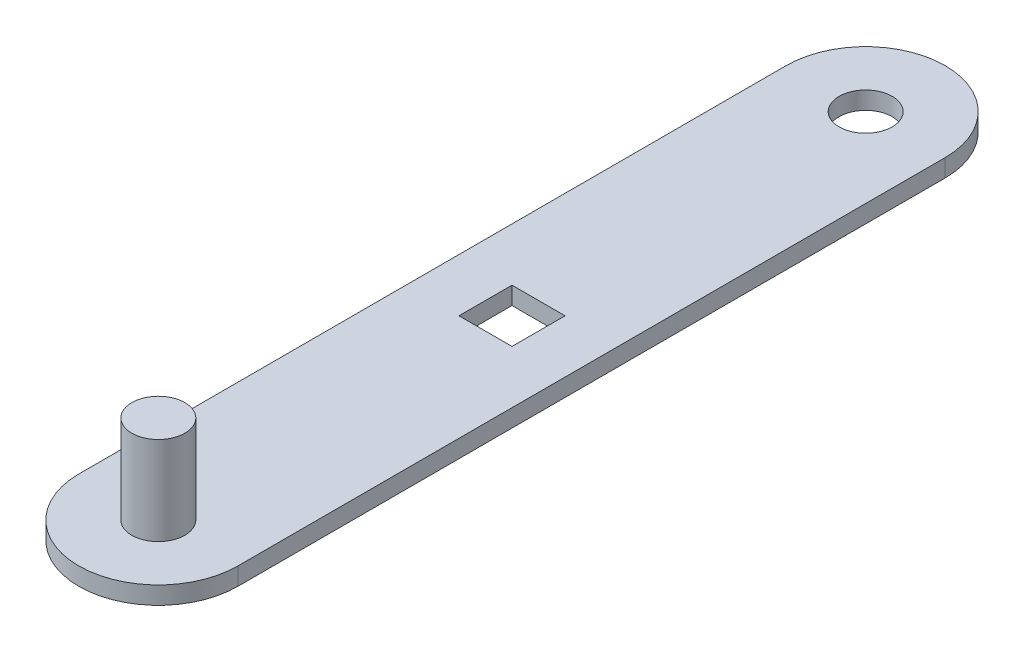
ISO-10303-21;
HEADER;
FILE_DESCRIPTION(('STEP AP214'),'2;1');
FILE_NAME('part.step','',(''),(''),'','','');
FILE_SCHEMA(('AUTOMOTIVE_DESIGN { 1 0 10303 214 1 1 1 1 }'));
ENDSEC;
DATA;
#1=APPLICATION_CONTEXT('core data for automotive mechanical design processes');
#2=APPLICATION_PROTOCOL_DEFINITION('international standard','automotive_design',2000,#1);
#3=PRODUCT_CONTEXT('',#1,'mechanical');
#4=PRODUCT('Part','Part','',(#3));
#5=PRODUCT_RELATED_PRODUCT_CATEGORY('part','',(#4));
#6=PRODUCT_DEFINITION_FORMATION('','',#4);
#7=PRODUCT_DEFINITION_CONTEXT('part definition',#1,'design');
#8=PRODUCT_DEFINITION('design','',#6,#7);
#9=PRODUCT_DEFINITION_SHAPE('','',#8);
#10=(LENGTH_UNIT() NAMED_UNIT(*) SI_UNIT(.MILLI.,.METRE.));
#11=(NAMED_UNIT(*) PLANE_ANGLE_UNIT() SI_UNIT($,.RADIAN.));
#12=(NAMED_UNIT(*) SI_UNIT($,.STERADIAN.) SOLID_ANGLE_UNIT());
#13=UNCERTAINTY_MEASURE_WITH_UNIT(LENGTH_MEASURE(1.E-05),#10,'distance_accuracy_value','');
#14=(GEOMETRIC_REPRESENTATION_CONTEXT(3) GLOBAL_UNCERTAINTY_ASSIGNED_CONTEXT((#13)) GLOBAL_UNIT_ASSIGNED_CONTEXT((#10,
#11,#12)) REPRESENTATION_CONTEXT('',''));
#15=CARTESIAN_POINT('',(0.,0.,0.));
#16=DIRECTION('',(0.,0.,1.));
#17=DIRECTION('',(1.,0.,0.));
#18=AXIS2_PLACEMENT_3D('',#15,#16,#17);
#19=CARTESIAN_POINT('',(-225.,50.,0.));
#20=DIRECTION('',(-1.,0.,0.));
#21=DIRECTION('',(0.,0.,1.));
#22=AXIS2_PLACEMENT_3D('',#19,#20,#21);
#23=PLANE('',#22);
#24=DIRECTION('',(0.,0.,-1.));
#25=VECTOR('',#24,1.);
#26=CARTESIAN_POINT('',(-225.,0.,0.));
#27=LINE('',#26,#25);
#28=CARTESIAN_POINT('',(-225.,0.,1000.));
#29=VERTEX_POINT('',#28);
#30=CARTESIAN_POINT('',(-225.,0.,-1000.));
#31=VERTEX_POINT('',#30);
#32=EDGE_CURVE('E158',#29,#31,#27,.T.);
#33=ORIENTED_EDGE('',*,*,#32,.F.);
#34=DIRECTION('',(0.,-1.,0.));
#35=VECTOR('',#34,1.);
#36=CARTESIAN_POINT('',(-225.,50.,1000.));
#37=LINE('',#36,#35);
#38=CARTESIAN_POINT('',(-225.,50.,1000.));
#39=VERTEX_POINT('',#38);
#40=EDGE_CURVE('E13',#39,#29,#37,.T.);
#41=ORIENTED_EDGE('',*,*,#40,.F.);
#42=DIRECTION('',(0.,0.,-1.));
#43=VECTOR('',#42,1.);
#44=CARTESIAN_POINT('',(-225.,50.,0.));
#45=LINE('',#44,#43);
#46=CARTESIAN_POINT('',(-225.,50.,-1000.));
#47=VERTEX_POINT('',#46);
#48=EDGE_CURVE('E162',#39,#47,#45,.T.);
#49=ORIENTED_EDGE('',*,*,#48,.T.);
#50=DIRECTION('',(0.,-1.,0.));
#51=VECTOR('',#50,1.);
#52=CARTESIAN_POINT('',(-225.,50.,-1000.));
#53=LINE('',#52,#51);
#54=EDGE_CURVE('E173',#47,#31,#53,.T.);
#55=ORIENTED_EDGE('',*,*,#54,.T.);
#56=EDGE_LOOP('',(#33,#41,#49,#55));
#57=FACE_BOUND('',#56,.T.);
#58=ADVANCED_FACE('F52',(#57),#23,.T.);
#59=CARTESIAN_POINT('',(0.,50.,1000.));
#60=DIRECTION('',(0.,-1.,0.));
#61=DIRECTION('',(0.,0.,-1.));
#62=AXIS2_PLACEMENT_3D('',#59,#60,#61);
#63=CYLINDRICAL_SURFACE('',#62,225.);
#64=CARTESIAN_POINT('',(0.,0.,1000.));
#65=DIRECTION('',(0.,1.,0.));
#66=DIRECTION('',(0.,0.,1.));
#67=AXIS2_PLACEMENT_3D('',#64,#65,#66);
#68=CIRCLE('',#67,225.);
#69=CARTESIAN_POINT('',(225.,0.,1000.));
#70=VERTEX_POINT('',#69);
#71=EDGE_CURVE('E176',#70,#29,#68,.F.);
#72=ORIENTED_EDGE('',*,*,#71,.F.);
#73=DIRECTION('',(0.,-1.,0.));
#74=VECTOR('',#73,1.);
#75=CARTESIAN_POINT('',(225.,50.,1000.));
#76=LINE('',#75,#74);
#77=CARTESIAN_POINT('',(225.,50.,1000.));
#78=VERTEX_POINT('',#77);
#79=EDGE_CURVE('E60',#78,#70,#76,.T.);
#80=ORIENTED_EDGE('',*,*,#79,.F.);
#81=CARTESIAN_POINT('',(0.,50.,1000.));
#82=DIRECTION('',(0.,1.,0.));
#83=DIRECTION('',(0.,0.,1.));
#84=AXIS2_PLACEMENT_3D('',#81,#82,#83);
#85=CIRCLE('',#84,225.);
#86=EDGE_CURVE('E165',#78,#39,#85,.F.);
#87=ORIENTED_EDGE('',*,*,#86,.T.);
#88=ORIENTED_EDGE('',*,*,#40,.T.);
#89=EDGE_LOOP('',(#72,#80,#87,#88));
#90=FACE_BOUND('',#89,.T.);
#91=ADVANCED_FACE('F197',(#90),#63,.T.);
#92=CARTESIAN_POINT('',(225.,50.,0.));
#93=DIRECTION('',(-1.,0.,0.));
#94=DIRECTION('',(0.,0.,1.));
#95=AXIS2_PLACEMENT_3D('',#92,#93,#94);
#96=PLANE('',#95);
#97=DIRECTION('',(0.,0.,-1.));
#98=VECTOR('',#97,1.);
#99=CARTESIAN_POINT('',(225.,0.,0.));
#100=LINE('',#99,#98);
#101=CARTESIAN_POINT('',(225.,0.,-1000.));
#102=VERTEX_POINT('',#101);
#103=EDGE_CURVE('E179',#70,#102,#100,.T.);
#104=ORIENTED_EDGE('',*,*,#103,.T.);
#105=DIRECTION('',(0.,-1.,0.));
#106=VECTOR('',#105,1.);
#107=CARTESIAN_POINT('',(225.,50.,-1000.));
#108=LINE('',#107,#106);
#109=CARTESIAN_POINT('',(225.,50.,-1000.));
#110=VERTEX_POINT('',#109);
#111=EDGE_CURVE('E184',#110,#102,#108,.T.);
#112=ORIENTED_EDGE('',*,*,#111,.F.);
#113=DIRECTION('',(0.,0.,-1.));
#114=VECTOR('',#113,1.);
#115=CARTESIAN_POINT('',(225.,50.,0.));
#116=LINE('',#115,#114);
#117=EDGE_CURVE('E169',#78,#110,#116,.T.);
#118=ORIENTED_EDGE('',*,*,#117,.F.);
#119=ORIENTED_EDGE('',*,*,#79,.T.);
#120=EDGE_LOOP('',(#104,#112,#118,#119));
#121=FACE_BOUND('',#120,.T.);
#122=ADVANCED_FACE('F190',(#121),#96,.F.);
#123=CARTESIAN_POINT('',(0.,50.,-1000.));
#124=DIRECTION('',(0.,-1.,0.));
#125=DIRECTION('',(0.,0.,-1.));
#126=AXIS2_PLACEMENT_3D('',#123,#124,#125);
#127=CYLINDRICAL_SURFACE('',#126,225.);
#128=CARTESIAN_POINT('',(0.,0.,-1000.));
#129=DIRECTION('',(0.,1.,0.));
#130=DIRECTION('',(0.,0.,1.));
#131=AXIS2_PLACEMENT_3D('',#128,#129,#130);
#132=CIRCLE('',#131,225.);
#133=EDGE_CURVE('E166',#102,#31,#132,.T.);
#134=ORIENTED_EDGE('',*,*,#133,.T.);
#135=ORIENTED_EDGE('',*,*,#54,.F.);
#136=CARTESIAN_POINT('',(0.,50.,-1000.));
#137=DIRECTION('',(0.,1.,0.));
#138=DIRECTION('',(0.,0.,1.));
#139=AXIS2_PLACEMENT_3D('',#136,#137,#138);
#140=CIRCLE('',#139,225.);
#141=EDGE_CURVE('E171',#110,#47,#140,.T.);
#142=ORIENTED_EDGE('',*,*,#141,.F.);
#143=ORIENTED_EDGE('',*,*,#111,.T.);
#144=EDGE_LOOP('',(#134,#135,#142,#143));
#145=FACE_BOUND('',#144,.T.);
#146=ADVANCED_FACE('F204',(#145),#127,.T.);
#147=CARTESIAN_POINT('',(0.,50.,0.));
#148=DIRECTION('',(0.,1.,0.));
#149=DIRECTION('',(0.,0.,1.));
#150=AXIS2_PLACEMENT_3D('',#147,#148,#149);
#151=PLANE('',#150);
#152=DIRECTION('',(0.,0.,-1.));
#153=VECTOR('',#152,1.);
#154=CARTESIAN_POINT('',(75.,50.,75.));
#155=LINE('',#154,#153);
#156=CARTESIAN_POINT('',(75.,50.,75.));
#157=VERTEX_POINT('',#156);
#158=CARTESIAN_POINT('',(75.,50.,-75.));
#159=VERTEX_POINT('',#158);
#160=EDGE_CURVE('E67',#157,#159,#155,.T.);
#161=ORIENTED_EDGE('',*,*,#160,.F.);
#162=DIRECTION('',(1.,0.,0.));
#163=VECTOR('',#162,1.);
#164=CARTESIAN_POINT('',(-75.,50.,75.));
#165=LINE('',#164,#163);
#166=CARTESIAN_POINT('',(-75.,50.,75.));
#167=VERTEX_POINT('',#166);
#168=EDGE_CURVE('E134',#167,#157,#165,.T.);
#169=ORIENTED_EDGE('',*,*,#168,.F.);
#170=DIRECTION('',(0.,0.,1.));
#171=VECTOR('',#170,1.);
#172=CARTESIAN_POINT('',(-75.,50.,75.));
#173=LINE('',#172,#171);
#174=CARTESIAN_POINT('',(-75.,50.,-75.));
#175=VERTEX_POINT('',#174);
#176=EDGE_CURVE('E137',#175,#167,#173,.T.);
#177=ORIENTED_EDGE('',*,*,#176,.F.);
#178=DIRECTION('',(-1.,0.,0.));
#179=VECTOR('',#178,1.);
#180=CARTESIAN_POINT('',(-75.,50.,-75.));
#181=LINE('',#180,#179);
#182=EDGE_CURVE('E143',#159,#175,#181,.T.);
#183=ORIENTED_EDGE('',*,*,#182,.F.);
#184=EDGE_LOOP('',(#161,#169,#177,#183));
#185=FACE_BOUND('',#184,.T.);
#186=CARTESIAN_POINT('',(0.,50.,-1000.));
#187=DIRECTION('',(0.,1.,0.));
#188=DIRECTION('',(0.,0.,1.));
#189=AXIS2_PLACEMENT_3D('',#186,#187,#188);
#190=CIRCLE('',#189,75.);
#191=CARTESIAN_POINT('',(0.,50.,-925.));
#192=VERTEX_POINT('',#191);
#193=EDGE_CURVE('E149',#192,#192,#190,.T.);
#194=ORIENTED_EDGE('',*,*,#193,.F.);
#195=EDGE_LOOP('',(#194));
#196=FACE_BOUND('',#195,.T.);
#197=CARTESIAN_POINT('',(0.,50.,1000.));
#198=DIRECTION('',(0.,1.,0.));
#199=DIRECTION('',(0.,0.,1.));
#200=AXIS2_PLACEMENT_3D('',#197,#198,#199);
#201=CIRCLE('',#200,75.);
#202=CARTESIAN_POINT('',(0.,50.,1075.));
#203=VERTEX_POINT('',#202);
#204=EDGE_CURVE('E159',#203,#203,#201,.T.);
#205=ORIENTED_EDGE('',*,*,#204,.F.);
#206=EDGE_LOOP('',(#205));
#207=FACE_BOUND('',#206,.T.);
#208=ORIENTED_EDGE('',*,*,#48,.F.);
#209=ORIENTED_EDGE('',*,*,#86,.F.);
#210=ORIENTED_EDGE('',*,*,#117,.T.);
#211=ORIENTED_EDGE('',*,*,#141,.T.);
#212=EDGE_LOOP('',(#208,#209,#210,#211));
#213=FACE_BOUND('',#212,.T.);
#214=ADVANCED_FACE('F206',(#185,#196,#207,#213),#151,.T.);
#215=CARTESIAN_POINT('',(0.,0.,0.));
#216=DIRECTION('',(0.,1.,0.));
#217=DIRECTION('',(0.,0.,1.));
#218=AXIS2_PLACEMENT_3D('',#215,#216,#217);
#219=PLANE('',#218);
#220=DIRECTION('',(1.,0.,0.));
#221=VECTOR('',#220,1.);
#222=CARTESIAN_POINT('',(-75.,0.,75.));
#223=LINE('',#222,#221);
#224=CARTESIAN_POINT('',(-75.,0.,75.));
#225=VERTEX_POINT('',#224);
#226=CARTESIAN_POINT('',(75.,0.,75.));
#227=VERTEX_POINT('',#226);
#228=EDGE_CURVE('E124',#225,#227,#223,.T.);
#229=ORIENTED_EDGE('',*,*,#228,.T.);
#230=DIRECTION('',(0.,0.,-1.));
#231=VECTOR('',#230,1.);
#232=CARTESIAN_POINT('',(75.,0.,75.));
#233=LINE('',#232,#231);
#234=CARTESIAN_POINT('',(75.,0.,-75.));
#235=VERTEX_POINT('',#234);
#236=EDGE_CURVE('E118',#227,#235,#233,.T.);
#237=ORIENTED_EDGE('',*,*,#236,.T.);
#238=DIRECTION('',(-1.,0.,0.));
#239=VECTOR('',#238,1.);
#240=CARTESIAN_POINT('',(-75.,0.,-75.));
#241=LINE('',#240,#239);
#242=CARTESIAN_POINT('',(-75.,0.,-75.));
#243=VERTEX_POINT('',#242);
#244=EDGE_CURVE('E127',#235,#243,#241,.T.);
#245=ORIENTED_EDGE('',*,*,#244,.T.);
#246=DIRECTION('',(0.,0.,1.));
#247=VECTOR('',#246,1.);
#248=CARTESIAN_POINT('',(-75.,0.,75.));
#249=LINE('',#248,#247);
#250=EDGE_CURVE('E75',#243,#225,#249,.T.);
#251=ORIENTED_EDGE('',*,*,#250,.T.);
#252=EDGE_LOOP('',(#229,#237,#245,#251));
#253=FACE_BOUND('',#252,.T.);
#254=CARTESIAN_POINT('',(0.,0.,-1000.));
#255=DIRECTION('',(0.,1.,0.));
#256=DIRECTION('',(0.,0.,1.));
#257=AXIS2_PLACEMENT_3D('',#254,#255,#256);
#258=CIRCLE('',#257,75.);
#259=CARTESIAN_POINT('',(0.,0.,-925.));
#260=VERTEX_POINT('',#259);
#261=EDGE_CURVE('E55',#260,#260,#258,.T.);
#262=ORIENTED_EDGE('',*,*,#261,.T.);
#263=EDGE_LOOP('',(#262));
#264=FACE_BOUND('',#263,.T.);
#265=ORIENTED_EDGE('',*,*,#32,.T.);
#266=ORIENTED_EDGE('',*,*,#133,.F.);
#267=ORIENTED_EDGE('',*,*,#103,.F.);
#268=ORIENTED_EDGE('',*,*,#71,.T.);
#269=EDGE_LOOP('',(#265,#266,#267,#268));
#270=FACE_BOUND('',#269,.T.);
#271=ADVANCED_FACE('F131',(#253,#264,#270),#219,.F.);
#272=CARTESIAN_POINT('',(0.,300.,1000.));
#273=DIRECTION('',(0.,-1.,0.));
#274=DIRECTION('',(0.,0.,-1.));
#275=AXIS2_PLACEMENT_3D('',#272,#273,#274);
#276=CYLINDRICAL_SURFACE('',#275,75.);
#277=CARTESIAN_POINT('',(0.,300.,1000.));
#278=DIRECTION('',(0.,1.,0.));
#279=DIRECTION('',(0.,0.,1.));
#280=AXIS2_PLACEMENT_3D('',#277,#278,#279);
#281=CIRCLE('',#280,75.);
#282=CARTESIAN_POINT('',(0.,300.,1075.));
#283=VERTEX_POINT('',#282);
#284=EDGE_CURVE('E155',#283,#283,#281,.T.);
#285=ORIENTED_EDGE('',*,*,#284,.F.);
#286=EDGE_LOOP('',(#285));
#287=FACE_BOUND('',#286,.T.);
#288=ORIENTED_EDGE('',*,*,#204,.T.);
#289=EDGE_LOOP('',(#288));
#290=FACE_BOUND('',#289,.T.);
#291=ADVANCED_FACE('F214',(#287,#290),#276,.T.);
#292=CARTESIAN_POINT('',(0.,300.,0.));
#293=DIRECTION('',(0.,1.,0.));
#294=DIRECTION('',(0.,0.,1.));
#295=AXIS2_PLACEMENT_3D('',#292,#293,#294);
#296=PLANE('',#295);
#297=ORIENTED_EDGE('',*,*,#284,.T.);
#298=EDGE_LOOP('',(#297));
#299=FACE_BOUND('',#298,.T.);
#300=ADVANCED_FACE('F255',(#299),#296,.T.);
#301=CARTESIAN_POINT('',(0.,-200.,-1000.));
#302=DIRECTION('',(0.,1.,0.));
#303=DIRECTION('',(0.,0.,1.));
#304=AXIS2_PLACEMENT_3D('',#301,#302,#303);
#305=CYLINDRICAL_SURFACE('',#304,75.);
#306=ORIENTED_EDGE('',*,*,#193,.T.);
#307=EDGE_LOOP('',(#306));
#308=FACE_BOUND('',#307,.T.);
#309=ORIENTED_EDGE('',*,*,#261,.F.);
#310=EDGE_LOOP('',(#309));
#311=FACE_BOUND('',#310,.T.);
#312=ADVANCED_FACE('F261',(#308,#311),#305,.F.);
#313=CARTESIAN_POINT('',(75.,0.,75.));
#314=DIRECTION('',(1.,0.,0.));
#315=DIRECTION('',(0.,0.,-1.));
#316=AXIS2_PLACEMENT_3D('',#313,#314,#315);
#317=PLANE('',#316);
#318=ORIENTED_EDGE('',*,*,#160,.T.);
#319=DIRECTION('',(0.,1.,0.));
#320=VECTOR('',#319,1.);
#321=CARTESIAN_POINT('',(75.,0.,-75.));
#322=LINE('',#321,#320);
#323=EDGE_CURVE('E114',#235,#159,#322,.T.);
#324=ORIENTED_EDGE('',*,*,#323,.F.);
#325=ORIENTED_EDGE('',*,*,#236,.F.);
#326=DIRECTION('',(0.,1.,0.));
#327=VECTOR('',#326,1.);
#328=CARTESIAN_POINT('',(75.,0.,75.));
#329=LINE('',#328,#327);
#330=EDGE_CURVE('E147',#227,#157,#329,.T.);
#331=ORIENTED_EDGE('',*,*,#330,.T.);
#332=EDGE_LOOP('',(#318,#324,#325,#331));
#333=FACE_BOUND('',#332,.T.);
#334=ADVANCED_FACE('F116',(#333),#317,.F.);
#335=CARTESIAN_POINT('',(-75.,0.,75.));
#336=DIRECTION('',(0.,0.,1.));
#337=DIRECTION('',(1.,0.,0.));
#338=AXIS2_PLACEMENT_3D('',#335,#336,#337);
#339=PLANE('',#338);
#340=ORIENTED_EDGE('',*,*,#168,.T.);
#341=ORIENTED_EDGE('',*,*,#330,.F.);
#342=ORIENTED_EDGE('',*,*,#228,.F.);
#343=DIRECTION('',(0.,1.,0.));
#344=VECTOR('',#343,1.);
#345=CARTESIAN_POINT('',(-75.,0.,75.));
#346=LINE('',#345,#344);
#347=EDGE_CURVE('E150',#225,#167,#346,.T.);
#348=ORIENTED_EDGE('',*,*,#347,.T.);
#349=EDGE_LOOP('',(#340,#341,#342,#348));
#350=FACE_BOUND('',#349,.T.);
#351=ADVANCED_FACE('F274',(#350),#339,.F.);
#352=CARTESIAN_POINT('',(-75.,0.,75.));
#353=DIRECTION('',(-1.,0.,0.));
#354=DIRECTION('',(0.,0.,1.));
#355=AXIS2_PLACEMENT_3D('',#352,#353,#354);
#356=PLANE('',#355);
#357=ORIENTED_EDGE('',*,*,#176,.T.);
#358=ORIENTED_EDGE('',*,*,#347,.F.);
#359=ORIENTED_EDGE('',*,*,#250,.F.);
#360=DIRECTION('',(0.,1.,0.));
#361=VECTOR('',#360,1.);
#362=CARTESIAN_POINT('',(-75.,0.,-75.));
#363=LINE('',#362,#361);
#364=EDGE_CURVE('E123',#243,#175,#363,.T.);
#365=ORIENTED_EDGE('',*,*,#364,.T.);
#366=EDGE_LOOP('',(#357,#358,#359,#365));
#367=FACE_BOUND('',#366,.T.);
#368=ADVANCED_FACE('F281',(#367),#356,.F.);
#369=CARTESIAN_POINT('',(-75.,0.,-75.));
#370=DIRECTION('',(0.,0.,-1.));
#371=DIRECTION('',(-1.,0.,0.));
#372=AXIS2_PLACEMENT_3D('',#369,#370,#371);
#373=PLANE('',#372);
#374=ORIENTED_EDGE('',*,*,#182,.T.);
#375=ORIENTED_EDGE('',*,*,#364,.F.);
#376=ORIENTED_EDGE('',*,*,#244,.F.);
#377=ORIENTED_EDGE('',*,*,#323,.T.);
#378=EDGE_LOOP('',(#374,#375,#376,#377));
#379=FACE_BOUND('',#378,.T.);
#380=ADVANCED_FACE('F128',(#379),#373,.F.);
#381=CLOSED_SHELL('',(#58,#91,#122,#146,#214,#271,#291,#300,#312,#334,#351,#368,#380));
#382=MANIFOLD_SOLID_BREP('B2',#381);
#383=ADVANCED_BREP_SHAPE_REPRESENTATION('',(#18,#382),#14);
#384=SHAPE_DEFINITION_REPRESENTATION(#9,#383);
ENDSEC;
END-ISO-10303-21;
